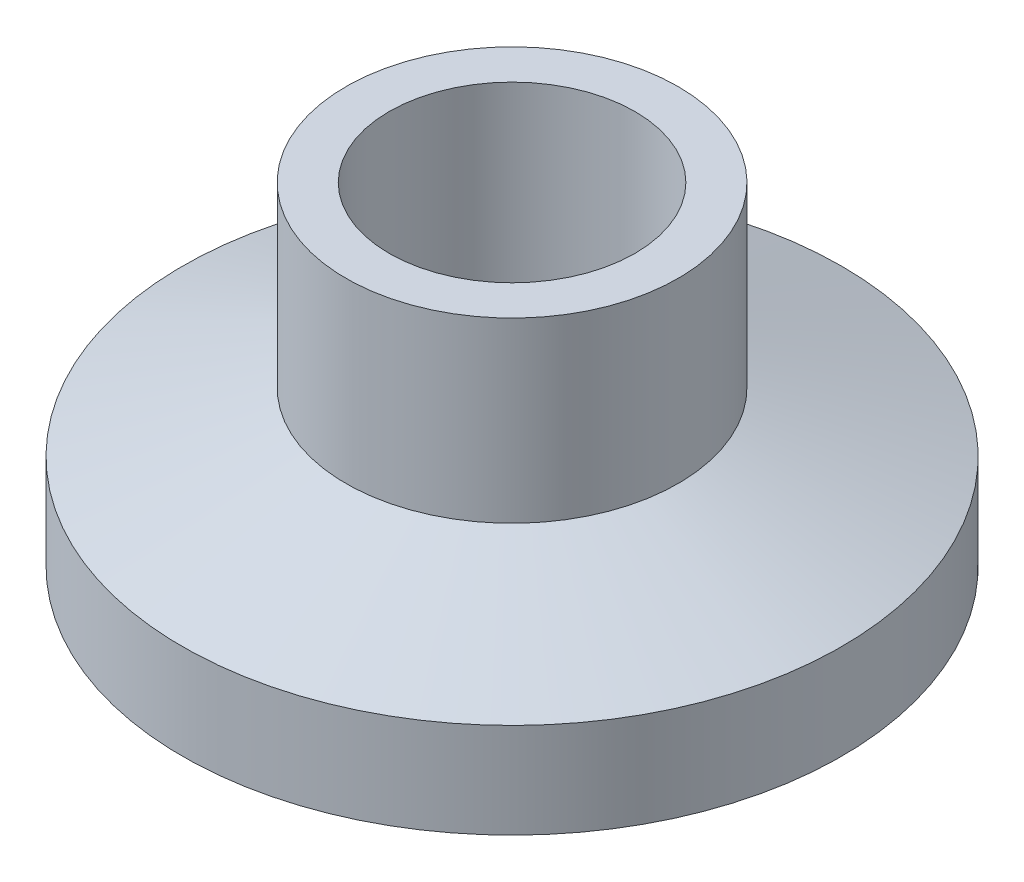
ISO-10303-21;
HEADER;
FILE_DESCRIPTION(('STEP AP214'),'2;1');
FILE_NAME('part.step','',(''),(''),'','','');
FILE_SCHEMA(('AUTOMOTIVE_DESIGN { 1 0 10303 214 1 1 1 1 }'));
ENDSEC;
DATA;
#1=APPLICATION_CONTEXT('core data for automotive mechanical design processes');
#2=APPLICATION_PROTOCOL_DEFINITION('international standard','automotive_design',2000,#1);
#3=PRODUCT_CONTEXT('',#1,'mechanical');
#4=PRODUCT('Part','Part','',(#3));
#5=PRODUCT_RELATED_PRODUCT_CATEGORY('part','',(#4));
#6=PRODUCT_DEFINITION_FORMATION('','',#4);
#7=PRODUCT_DEFINITION_CONTEXT('part definition',#1,'design');
#8=PRODUCT_DEFINITION('design','',#6,#7);
#9=PRODUCT_DEFINITION_SHAPE('','',#8);
#10=(LENGTH_UNIT() NAMED_UNIT(*) SI_UNIT(.MILLI.,.METRE.));
#11=(NAMED_UNIT(*) PLANE_ANGLE_UNIT() SI_UNIT($,.RADIAN.));
#12=(NAMED_UNIT(*) SI_UNIT($,.STERADIAN.) SOLID_ANGLE_UNIT());
#13=UNCERTAINTY_MEASURE_WITH_UNIT(LENGTH_MEASURE(1.E-05),#10,'distance_accuracy_value','');
#14=(GEOMETRIC_REPRESENTATION_CONTEXT(3) GLOBAL_UNCERTAINTY_ASSIGNED_CONTEXT((#13)) GLOBAL_UNIT_ASSIGNED_CONTEXT((#10,
#11,#12)) REPRESENTATION_CONTEXT('',''));
#15=CARTESIAN_POINT('',(0.,0.,0.));
#16=DIRECTION('',(0.,0.,1.));
#17=DIRECTION('',(1.,0.,0.));
#18=AXIS2_PLACEMENT_3D('',#15,#16,#17);
#19=CARTESIAN_POINT('',(0.,0.,0.));
#20=DIRECTION('',(0.,-1.,0.));
#21=DIRECTION('',(0.,0.,-0.999999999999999));
#22=AXIS2_PLACEMENT_3D('',#19,#20,#21);
#23=CYLINDRICAL_SURFACE('',#22,10.922);
#24=CARTESIAN_POINT('',(0.,1.32080000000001,0.));
#25=DIRECTION('',(0.,-1.,0.));
#26=DIRECTION('',(0.,0.,-0.999999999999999));
#27=AXIS2_PLACEMENT_3D('',#24,#25,#26);
#28=CIRCLE('',#27,10.922);
#29=CARTESIAN_POINT('',(0.,1.32080000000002,-10.922));
#30=VERTEX_POINT('',#29);
#31=EDGE_CURVE('E12',#30,#30,#28,.T.);
#32=ORIENTED_EDGE('',*,*,#31,.F.);
#33=EDGE_LOOP('',(#32));
#34=FACE_BOUND('',#33,.T.);
#35=CARTESIAN_POINT('',(0.,0.,0.));
#36=DIRECTION('',(0.,-1.,0.));
#37=DIRECTION('',(0.,0.,-0.999999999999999));
#38=AXIS2_PLACEMENT_3D('',#35,#36,#37);
#39=CIRCLE('',#38,10.922);
#40=CARTESIAN_POINT('',(0.,0.,-10.922));
#41=VERTEX_POINT('',#40);
#42=EDGE_CURVE('E72',#41,#41,#39,.T.);
#43=ORIENTED_EDGE('',*,*,#42,.T.);
#44=EDGE_LOOP('',(#43));
#45=FACE_BOUND('',#44,.T.);
#46=ADVANCED_FACE('F38',(#34,#45),#23,.F.);
#47=CARTESIAN_POINT('',(0.,1.32080000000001,0.));
#48=DIRECTION('',(0.,-1.,0.));
#49=DIRECTION('',(0.,0.,-0.999999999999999));
#50=AXIS2_PLACEMENT_3D('',#47,#48,#49);
#51=TOROIDAL_SURFACE('',#50,10.1473,0.7747);
#52=CARTESIAN_POINT('',(0.,1.85299891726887,0.));
#53=DIRECTION('',(0.,-1.,0.));
#54=DIRECTION('',(0.,0.,-0.999999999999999));
#55=AXIS2_PLACEMENT_3D('',#52,#53,#54);
#56=CIRCLE('',#55,9.58433960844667);
#57=CARTESIAN_POINT('',(0.,1.85299891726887,-9.58433960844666));
#58=VERTEX_POINT('',#57);
#59=EDGE_CURVE('E44',#58,#58,#56,.T.);
#60=ORIENTED_EDGE('',*,*,#59,.F.);
#61=EDGE_LOOP('',(#60));
#62=FACE_BOUND('',#61,.T.);
#63=ORIENTED_EDGE('',*,*,#31,.T.);
#64=EDGE_LOOP('',(#63));
#65=FACE_BOUND('',#64,.T.);
#66=ADVANCED_FACE('F121',(#62,#65),#51,.F.);
#67=CARTESIAN_POINT('',(0.,1.85299891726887,0.));
#68=DIRECTION('',(0.,1.,0.));
#69=DIRECTION('',(0.,0.,0.999999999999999));
#70=AXIS2_PLACEMENT_3D('',#67,#68,#69);
#71=CONICAL_SURFACE('',#70,9.58433960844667,0.794623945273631);
#72=CARTESIAN_POINT('',(0.,0.889000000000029,0.));
#73=DIRECTION('',(0.,-1.,0.));
#74=DIRECTION('',(0.,0.,-0.999999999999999));
#75=AXIS2_PLACEMENT_3D('',#72,#73,#74);
#76=CIRCLE('',#75,8.60238725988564);
#77=CARTESIAN_POINT('',(0.,0.889000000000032,-8.60238725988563));
#78=VERTEX_POINT('',#77);
#79=EDGE_CURVE('E48',#78,#78,#76,.T.);
#80=ORIENTED_EDGE('',*,*,#79,.F.);
#81=EDGE_LOOP('',(#80));
#82=FACE_BOUND('',#81,.T.);
#83=ORIENTED_EDGE('',*,*,#59,.T.);
#84=EDGE_LOOP('',(#83));
#85=FACE_BOUND('',#84,.T.);
#86=ADVANCED_FACE('F116',(#82,#85),#71,.T.);
#87=CARTESIAN_POINT('',(-8.60238725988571,0.889000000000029,2.77555756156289E-13));
#88=DIRECTION('',(0.,1.,0.));
#89=DIRECTION('',(0.,0.,0.999999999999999));
#90=AXIS2_PLACEMENT_3D('',#87,#88,#89);
#91=PLANE('',#90);
#92=CARTESIAN_POINT('',(0.,0.889000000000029,0.));
#93=DIRECTION('',(0.,-1.,0.));
#94=DIRECTION('',(0.,0.,-0.999999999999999));
#95=AXIS2_PLACEMENT_3D('',#92,#93,#94);
#96=CIRCLE('',#95,4.699);
#97=CARTESIAN_POINT('',(0.,0.88900000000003,-4.69899999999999));
#98=VERTEX_POINT('',#97);
#99=EDGE_CURVE('E52',#98,#98,#96,.T.);
#100=ORIENTED_EDGE('',*,*,#99,.F.);
#101=EDGE_LOOP('',(#100));
#102=FACE_BOUND('',#101,.T.);
#103=ORIENTED_EDGE('',*,*,#79,.T.);
#104=EDGE_LOOP('',(#103));
#105=FACE_BOUND('',#104,.T.);
#106=ADVANCED_FACE('F110',(#102,#105),#91,.F.);
#107=CARTESIAN_POINT('',(0.,0.,0.));
#108=DIRECTION('',(0.,-1.,0.));
#109=DIRECTION('',(0.,0.,-0.999999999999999));
#110=AXIS2_PLACEMENT_3D('',#107,#108,#109);
#111=CYLINDRICAL_SURFACE('',#110,4.699);
#112=CARTESIAN_POINT('',(0.,12.7,-1.11022302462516E-13));
#113=DIRECTION('',(0.,-1.,0.));
#114=DIRECTION('',(0.,0.,-0.999999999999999));
#115=AXIS2_PLACEMENT_3D('',#112,#113,#114);
#116=CIRCLE('',#115,4.699);
#117=CARTESIAN_POINT('',(0.,12.7,-4.6990000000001));
#118=VERTEX_POINT('',#117);
#119=EDGE_CURVE('E57',#118,#118,#116,.T.);
#120=ORIENTED_EDGE('',*,*,#119,.F.);
#121=EDGE_LOOP('',(#120));
#122=FACE_BOUND('',#121,.T.);
#123=ORIENTED_EDGE('',*,*,#99,.T.);
#124=EDGE_LOOP('',(#123));
#125=FACE_BOUND('',#124,.T.);
#126=ADVANCED_FACE('F104',(#122,#125),#111,.F.);
#127=CARTESIAN_POINT('',(-4.69900000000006,12.7,7.21644966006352E-13));
#128=DIRECTION('',(0.,-1.,0.));
#129=DIRECTION('',(0.,0.,-0.999999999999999));
#130=AXIS2_PLACEMENT_3D('',#127,#128,#129);
#131=PLANE('',#130);
#132=CARTESIAN_POINT('',(0.,12.7,-1.11022302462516E-13));
#133=DIRECTION('',(0.,-1.,0.));
#134=DIRECTION('',(0.,0.,-0.999999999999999));
#135=AXIS2_PLACEMENT_3D('',#132,#133,#134);
#136=CIRCLE('',#135,6.35);
#137=CARTESIAN_POINT('',(0.,12.7,-6.3500000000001));
#138=VERTEX_POINT('',#137);
#139=EDGE_CURVE('E60',#138,#138,#136,.T.);
#140=ORIENTED_EDGE('',*,*,#139,.F.);
#141=EDGE_LOOP('',(#140));
#142=FACE_BOUND('',#141,.T.);
#143=ORIENTED_EDGE('',*,*,#119,.T.);
#144=EDGE_LOOP('',(#143));
#145=FACE_BOUND('',#144,.T.);
#146=ADVANCED_FACE('F98',(#142,#145),#131,.F.);
#147=CARTESIAN_POINT('',(0.,0.,0.));
#148=DIRECTION('',(0.,-1.,0.));
#149=DIRECTION('',(0.,0.,-0.999999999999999));
#150=AXIS2_PLACEMENT_3D('',#147,#148,#149);
#151=CYLINDRICAL_SURFACE('',#150,6.35);
#152=CARTESIAN_POINT('',(0.,5.90643161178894,0.));
#153=DIRECTION('',(0.,-1.,0.));
#154=DIRECTION('',(0.,0.,-0.999999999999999));
#155=AXIS2_PLACEMENT_3D('',#152,#153,#154);
#156=CIRCLE('',#155,6.35);
#157=CARTESIAN_POINT('',(0.,5.90643161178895,-6.34999999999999));
#158=VERTEX_POINT('',#157);
#159=EDGE_CURVE('E63',#158,#158,#156,.T.);
#160=ORIENTED_EDGE('',*,*,#159,.F.);
#161=EDGE_LOOP('',(#160));
#162=FACE_BOUND('',#161,.T.);
#163=ORIENTED_EDGE('',*,*,#139,.T.);
#164=EDGE_LOOP('',(#163));
#165=FACE_BOUND('',#164,.T.);
#166=ADVANCED_FACE('F92',(#162,#165),#151,.T.);
#167=CARTESIAN_POINT('',(0.,5.90643161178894,0.));
#168=DIRECTION('',(0.,-1.,0.));
#169=DIRECTION('',(0.,0.,-0.999999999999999));
#170=AXIS2_PLACEMENT_3D('',#167,#168,#169);
#171=CONICAL_SURFACE('',#170,6.35,1.22173047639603);
#172=CARTESIAN_POINT('',(0.,3.63219999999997,0.));
#173=DIRECTION('',(0.,-1.,0.));
#174=DIRECTION('',(0.,0.,-0.999999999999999));
#175=AXIS2_PLACEMENT_3D('',#172,#173,#174);
#176=CIRCLE('',#175,12.5984);
#177=CARTESIAN_POINT('',(0.,3.63219999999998,-12.5984));
#178=VERTEX_POINT('',#177);
#179=EDGE_CURVE('E66',#178,#178,#176,.T.);
#180=ORIENTED_EDGE('',*,*,#179,.F.);
#181=EDGE_LOOP('',(#180));
#182=FACE_BOUND('',#181,.T.);
#183=ORIENTED_EDGE('',*,*,#159,.T.);
#184=EDGE_LOOP('',(#183));
#185=FACE_BOUND('',#184,.T.);
#186=ADVANCED_FACE('F86',(#182,#185),#171,.T.);
#187=CARTESIAN_POINT('',(0.,0.,0.));
#188=DIRECTION('',(0.,-1.,0.));
#189=DIRECTION('',(0.,0.,-0.999999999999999));
#190=AXIS2_PLACEMENT_3D('',#187,#188,#189);
#191=CYLINDRICAL_SURFACE('',#190,12.5984);
#192=CARTESIAN_POINT('',(0.,0.,0.));
#193=DIRECTION('',(0.,-1.,0.));
#194=DIRECTION('',(0.,0.,-0.999999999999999));
#195=AXIS2_PLACEMENT_3D('',#192,#193,#194);
#196=CIRCLE('',#195,12.5984);
#197=CARTESIAN_POINT('',(0.,0.,-12.5984));
#198=VERTEX_POINT('',#197);
#199=EDGE_CURVE('E69',#198,#198,#196,.T.);
#200=ORIENTED_EDGE('',*,*,#199,.F.);
#201=EDGE_LOOP('',(#200));
#202=FACE_BOUND('',#201,.T.);
#203=ORIENTED_EDGE('',*,*,#179,.T.);
#204=EDGE_LOOP('',(#203));
#205=FACE_BOUND('',#204,.T.);
#206=ADVANCED_FACE('F80',(#202,#205),#191,.T.);
#207=CARTESIAN_POINT('',(-12.5984000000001,0.,0.));
#208=DIRECTION('',(0.,1.,0.));
#209=DIRECTION('',(0.,0.,0.999999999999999));
#210=AXIS2_PLACEMENT_3D('',#207,#208,#209);
#211=PLANE('',#210);
#212=ORIENTED_EDGE('',*,*,#42,.F.);
#213=EDGE_LOOP('',(#212));
#214=FACE_BOUND('',#213,.T.);
#215=ORIENTED_EDGE('',*,*,#199,.T.);
#216=EDGE_LOOP('',(#215));
#217=FACE_BOUND('',#216,.T.);
#218=ADVANCED_FACE('F77',(#214,#217),#211,.F.);
#219=CLOSED_SHELL('',(#46,#66,#86,#106,#126,#146,#166,#186,#206,#218));
#220=MANIFOLD_SOLID_BREP('B2',#219);
#221=ADVANCED_BREP_SHAPE_REPRESENTATION('',(#18,#220),#14);
#222=SHAPE_DEFINITION_REPRESENTATION(#9,#221);
ENDSEC;
END-ISO-10303-21;
